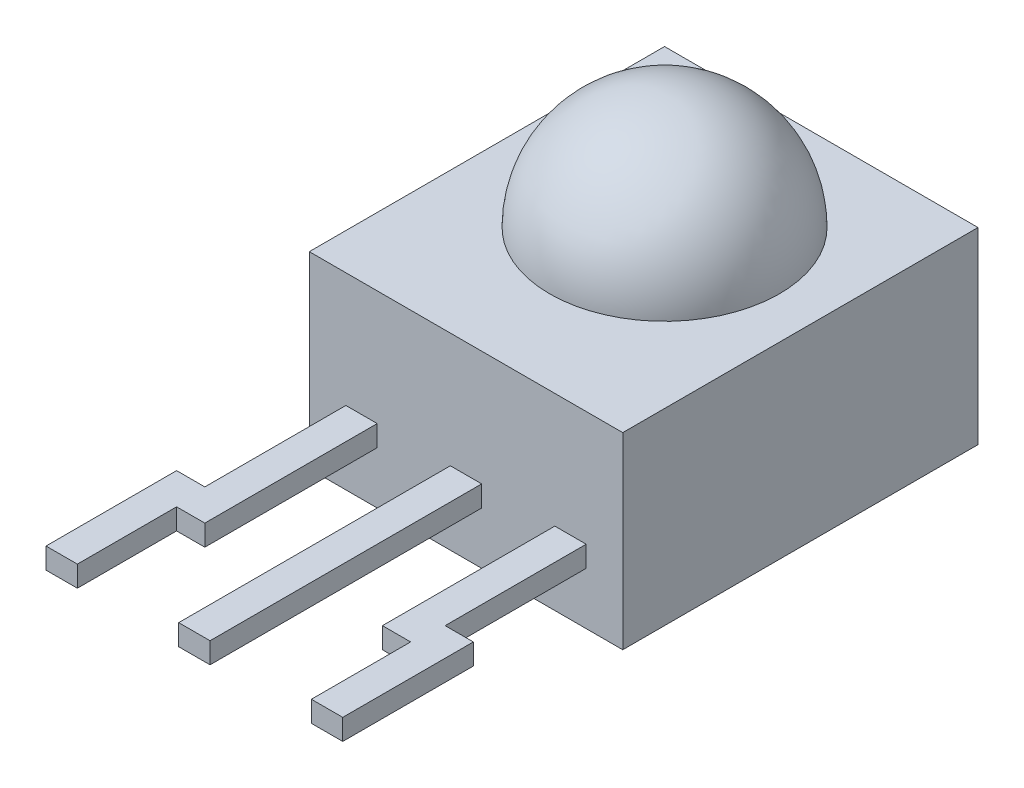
ISO-10303-21;
HEADER;
FILE_DESCRIPTION(('STEP AP214'),'2;1');
FILE_NAME('part.step','',(''),(''),'','','');
FILE_SCHEMA(('AUTOMOTIVE_DESIGN { 1 0 10303 214 1 1 1 1 }'));
ENDSEC;
DATA;
#1=APPLICATION_CONTEXT('core data for automotive mechanical design processes');
#2=APPLICATION_PROTOCOL_DEFINITION('international standard','automotive_design',2000,#1);
#3=PRODUCT_CONTEXT('',#1,'mechanical');
#4=PRODUCT('Part','Part','',(#3));
#5=PRODUCT_RELATED_PRODUCT_CATEGORY('part','',(#4));
#6=PRODUCT_DEFINITION_FORMATION('','',#4);
#7=PRODUCT_DEFINITION_CONTEXT('part definition',#1,'design');
#8=PRODUCT_DEFINITION('design','',#6,#7);
#9=PRODUCT_DEFINITION_SHAPE('','',#8);
#10=(LENGTH_UNIT() NAMED_UNIT(*) SI_UNIT(.MILLI.,.METRE.));
#11=(NAMED_UNIT(*) PLANE_ANGLE_UNIT() SI_UNIT($,.RADIAN.));
#12=(NAMED_UNIT(*) SI_UNIT($,.STERADIAN.) SOLID_ANGLE_UNIT());
#13=UNCERTAINTY_MEASURE_WITH_UNIT(LENGTH_MEASURE(1.E-05),#10,'distance_accuracy_value','');
#14=(GEOMETRIC_REPRESENTATION_CONTEXT(3) GLOBAL_UNCERTAINTY_ASSIGNED_CONTEXT((#13)) GLOBAL_UNIT_ASSIGNED_CONTEXT((#10,
#11,#12)) REPRESENTATION_CONTEXT('',''));
#15=CARTESIAN_POINT('',(0.,0.,0.));
#16=DIRECTION('',(0.,0.,1.));
#17=DIRECTION('',(1.,0.,0.));
#18=AXIS2_PLACEMENT_3D('',#15,#16,#17);
#19=CARTESIAN_POINT('',(-3.,2.4,0.));
#20=DIRECTION('',(0.,0.,-1.));
#21=DIRECTION('',(-1.,0.,0.));
#22=AXIS2_PLACEMENT_3D('',#19,#20,#21);
#23=PLANE('',#22);
#24=DIRECTION('',(-1.,0.,0.));
#25=VECTOR('',#24,1.);
#26=CARTESIAN_POINT('',(-2.3,0.2,0.));
#27=LINE('',#26,#25);
#28=CARTESIAN_POINT('',(-1.7,0.2,0.));
#29=VERTEX_POINT('',#28);
#30=CARTESIAN_POINT('',(-2.3,0.2,0.));
#31=VERTEX_POINT('',#30);
#32=EDGE_CURVE('E305',#29,#31,#27,.T.);
#33=ORIENTED_EDGE('',*,*,#32,.F.);
#34=DIRECTION('',(0.,1.,0.));
#35=VECTOR('',#34,1.);
#36=CARTESIAN_POINT('',(-1.7,0.2,0.));
#37=LINE('',#36,#35);
#38=CARTESIAN_POINT('',(-1.7,-0.2,0.));
#39=VERTEX_POINT('',#38);
#40=EDGE_CURVE('E302',#39,#29,#37,.T.);
#41=ORIENTED_EDGE('',*,*,#40,.F.);
#42=DIRECTION('',(1.,0.,0.));
#43=VECTOR('',#42,1.);
#44=CARTESIAN_POINT('',(-2.3,-0.2,0.));
#45=LINE('',#44,#43);
#46=CARTESIAN_POINT('',(-2.3,-0.2,0.));
#47=VERTEX_POINT('',#46);
#48=EDGE_CURVE('E299',#47,#39,#45,.T.);
#49=ORIENTED_EDGE('',*,*,#48,.F.);
#50=DIRECTION('',(0.,-1.,0.));
#51=VECTOR('',#50,1.);
#52=CARTESIAN_POINT('',(-2.3,0.2,0.));
#53=LINE('',#52,#51);
#54=EDGE_CURVE('E213',#31,#47,#53,.T.);
#55=ORIENTED_EDGE('',*,*,#54,.F.);
#56=EDGE_LOOP('',(#33,#41,#49,#55));
#57=FACE_BOUND('',#56,.T.);
#58=DIRECTION('',(1.,0.,0.));
#59=VECTOR('',#58,1.);
#60=CARTESIAN_POINT('',(-3.,-1.2,0.));
#61=LINE('',#60,#59);
#62=CARTESIAN_POINT('',(-3.,-1.2,0.));
#63=VERTEX_POINT('',#62);
#64=CARTESIAN_POINT('',(3.,-1.2,0.));
#65=VERTEX_POINT('',#64);
#66=EDGE_CURVE('E349',#63,#65,#61,.T.);
#67=ORIENTED_EDGE('',*,*,#66,.T.);
#68=DIRECTION('',(0.,-1.,0.));
#69=VECTOR('',#68,1.);
#70=CARTESIAN_POINT('',(3.,2.4,0.));
#71=LINE('',#70,#69);
#72=CARTESIAN_POINT('',(3.,2.4,0.));
#73=VERTEX_POINT('',#72);
#74=EDGE_CURVE('E25',#73,#65,#71,.T.);
#75=ORIENTED_EDGE('',*,*,#74,.F.);
#76=DIRECTION('',(1.,0.,0.));
#77=VECTOR('',#76,1.);
#78=CARTESIAN_POINT('',(-3.,2.4,0.));
#79=LINE('',#78,#77);
#80=CARTESIAN_POINT('',(-3.,2.4,0.));
#81=VERTEX_POINT('',#80);
#82=EDGE_CURVE('E358',#81,#73,#79,.T.);
#83=ORIENTED_EDGE('',*,*,#82,.F.);
#84=DIRECTION('',(0.,-1.,0.));
#85=VECTOR('',#84,1.);
#86=CARTESIAN_POINT('',(-3.,2.4,0.));
#87=LINE('',#86,#85);
#88=EDGE_CURVE('E11',#81,#63,#87,.T.);
#89=ORIENTED_EDGE('',*,*,#88,.T.);
#90=EDGE_LOOP('',(#67,#75,#83,#89));
#91=FACE_BOUND('',#90,.T.);
#92=DIRECTION('',(1.,0.,0.));
#93=VECTOR('',#92,1.);
#94=CARTESIAN_POINT('',(2.3,0.2,0.));
#95=LINE('',#94,#93);
#96=CARTESIAN_POINT('',(1.7,0.2,0.));
#97=VERTEX_POINT('',#96);
#98=CARTESIAN_POINT('',(2.3,0.2,0.));
#99=VERTEX_POINT('',#98);
#100=EDGE_CURVE('E236',#97,#99,#95,.T.);
#101=ORIENTED_EDGE('',*,*,#100,.T.);
#102=DIRECTION('',(0.,-1.,0.));
#103=VECTOR('',#102,1.);
#104=CARTESIAN_POINT('',(2.3,0.2,0.));
#105=LINE('',#104,#103);
#106=CARTESIAN_POINT('',(2.3,-0.2,0.));
#107=VERTEX_POINT('',#106);
#108=EDGE_CURVE('E209',#99,#107,#105,.T.);
#109=ORIENTED_EDGE('',*,*,#108,.T.);
#110=DIRECTION('',(-1.,0.,0.));
#111=VECTOR('',#110,1.);
#112=CARTESIAN_POINT('',(2.3,-0.2,0.));
#113=LINE('',#112,#111);
#114=CARTESIAN_POINT('',(1.7,-0.2,0.));
#115=VERTEX_POINT('',#114);
#116=EDGE_CURVE('E242',#107,#115,#113,.T.);
#117=ORIENTED_EDGE('',*,*,#116,.T.);
#118=DIRECTION('',(0.,1.,0.));
#119=VECTOR('',#118,1.);
#120=CARTESIAN_POINT('',(1.7,0.2,0.));
#121=LINE('',#120,#119);
#122=EDGE_CURVE('E239',#115,#97,#121,.T.);
#123=ORIENTED_EDGE('',*,*,#122,.T.);
#124=EDGE_LOOP('',(#101,#109,#117,#123));
#125=FACE_BOUND('',#124,.T.);
#126=DIRECTION('',(0.,-1.,0.));
#127=VECTOR('',#126,1.);
#128=CARTESIAN_POINT('',(-0.3,-0.2,0.));
#129=LINE('',#128,#127);
#130=CARTESIAN_POINT('',(-0.3,0.2,0.));
#131=VERTEX_POINT('',#130);
#132=CARTESIAN_POINT('',(-0.3,-0.2,0.));
#133=VERTEX_POINT('',#132);
#134=EDGE_CURVE('E174',#131,#133,#129,.T.);
#135=ORIENTED_EDGE('',*,*,#134,.F.);
#136=DIRECTION('',(-1.,0.,0.));
#137=VECTOR('',#136,1.);
#138=CARTESIAN_POINT('',(-0.3,0.2,0.));
#139=LINE('',#138,#137);
#140=CARTESIAN_POINT('',(0.3,0.2,0.));
#141=VERTEX_POINT('',#140);
#142=EDGE_CURVE('E176',#141,#131,#139,.T.);
#143=ORIENTED_EDGE('',*,*,#142,.F.);
#144=DIRECTION('',(0.,1.,0.));
#145=VECTOR('',#144,1.);
#146=CARTESIAN_POINT('',(0.3,-0.2,0.));
#147=LINE('',#146,#145);
#148=CARTESIAN_POINT('',(0.3,-0.2,0.));
#149=VERTEX_POINT('',#148);
#150=EDGE_CURVE('E37',#149,#141,#147,.T.);
#151=ORIENTED_EDGE('',*,*,#150,.F.);
#152=DIRECTION('',(1.,0.,0.));
#153=VECTOR('',#152,1.);
#154=CARTESIAN_POINT('',(-0.3,-0.2,0.));
#155=LINE('',#154,#153);
#156=EDGE_CURVE('E32',#133,#149,#155,.T.);
#157=ORIENTED_EDGE('',*,*,#156,.F.);
#158=EDGE_LOOP('',(#135,#143,#151,#157));
#159=FACE_BOUND('',#158,.T.);
#160=ADVANCED_FACE('F17',(#57,#91,#125,#159),#23,.F.);
#161=CARTESIAN_POINT('',(-3.,2.4,0.));
#162=DIRECTION('',(0.,1.,0.));
#163=DIRECTION('',(0.,0.,1.));
#164=AXIS2_PLACEMENT_3D('',#161,#162,#163);
#165=PLANE('',#164);
#166=DIRECTION('',(0.,0.,1.));
#167=VECTOR('',#166,1.);
#168=CARTESIAN_POINT('',(-3.,2.4,-6.8));
#169=LINE('',#168,#167);
#170=CARTESIAN_POINT('',(-3.,2.4,-6.8));
#171=VERTEX_POINT('',#170);
#172=EDGE_CURVE('E355',#171,#81,#169,.T.);
#173=ORIENTED_EDGE('',*,*,#172,.T.);
#174=ORIENTED_EDGE('',*,*,#82,.T.);
#175=DIRECTION('',(0.,0.,-1.));
#176=VECTOR('',#175,1.);
#177=CARTESIAN_POINT('',(3.,2.4,-6.8));
#178=LINE('',#177,#176);
#179=CARTESIAN_POINT('',(3.,2.4,-6.8));
#180=VERTEX_POINT('',#179);
#181=EDGE_CURVE('E360',#73,#180,#178,.T.);
#182=ORIENTED_EDGE('',*,*,#181,.T.);
#183=DIRECTION('',(-1.,0.,0.));
#184=VECTOR('',#183,1.);
#185=CARTESIAN_POINT('',(-3.,2.4,-6.8));
#186=LINE('',#185,#184);
#187=EDGE_CURVE('E362',#180,#171,#186,.T.);
#188=ORIENTED_EDGE('',*,*,#187,.T.);
#189=EDGE_LOOP('',(#173,#174,#182,#188));
#190=FACE_BOUND('',#189,.T.);
#191=CARTESIAN_POINT('',(0.,2.4,-3.8));
#192=DIRECTION('',(0.,1.,0.));
#193=DIRECTION('',(0.,0.,1.));
#194=AXIS2_PLACEMENT_3D('',#191,#192,#193);
#195=CIRCLE('',#194,2.2);
#196=CARTESIAN_POINT('',(0.,2.4,-1.6));
#197=VERTEX_POINT('',#196);
#198=EDGE_CURVE('E206',#197,#197,#195,.T.);
#199=ORIENTED_EDGE('',*,*,#198,.F.);
#200=EDGE_LOOP('',(#199));
#201=FACE_BOUND('',#200,.T.);
#202=ADVANCED_FACE('F389',(#190,#201),#165,.T.);
#203=CARTESIAN_POINT('',(-3.,2.4,-6.8));
#204=DIRECTION('',(1.,0.,0.));
#205=DIRECTION('',(0.,0.,-1.));
#206=AXIS2_PLACEMENT_3D('',#203,#204,#205);
#207=PLANE('',#206);
#208=DIRECTION('',(0.,0.,1.));
#209=VECTOR('',#208,1.);
#210=CARTESIAN_POINT('',(-3.,-1.2,-6.8));
#211=LINE('',#210,#209);
#212=CARTESIAN_POINT('',(-3.,-1.2,-6.8));
#213=VERTEX_POINT('',#212);
#214=EDGE_CURVE('E346',#213,#63,#211,.T.);
#215=ORIENTED_EDGE('',*,*,#214,.T.);
#216=ORIENTED_EDGE('',*,*,#88,.F.);
#217=ORIENTED_EDGE('',*,*,#172,.F.);
#218=DIRECTION('',(0.,-1.,0.));
#219=VECTOR('',#218,1.);
#220=CARTESIAN_POINT('',(-3.,2.4,-6.8));
#221=LINE('',#220,#219);
#222=EDGE_CURVE('E364',#171,#213,#221,.T.);
#223=ORIENTED_EDGE('',*,*,#222,.T.);
#224=EDGE_LOOP('',(#215,#216,#217,#223));
#225=FACE_BOUND('',#224,.T.);
#226=ADVANCED_FACE('F19',(#225),#207,.F.);
#227=CARTESIAN_POINT('',(3.,2.4,-6.8));
#228=DIRECTION('',(-1.,0.,0.));
#229=DIRECTION('',(0.,0.,1.));
#230=AXIS2_PLACEMENT_3D('',#227,#228,#229);
#231=PLANE('',#230);
#232=DIRECTION('',(0.,0.,-1.));
#233=VECTOR('',#232,1.);
#234=CARTESIAN_POINT('',(3.,-1.2,-6.8));
#235=LINE('',#234,#233);
#236=CARTESIAN_POINT('',(3.,-1.2,-6.8));
#237=VERTEX_POINT('',#236);
#238=EDGE_CURVE('E351',#65,#237,#235,.T.);
#239=ORIENTED_EDGE('',*,*,#238,.T.);
#240=DIRECTION('',(0.,-1.,0.));
#241=VECTOR('',#240,1.);
#242=CARTESIAN_POINT('',(3.,2.4,-6.8));
#243=LINE('',#242,#241);
#244=EDGE_CURVE('E367',#180,#237,#243,.T.);
#245=ORIENTED_EDGE('',*,*,#244,.F.);
#246=ORIENTED_EDGE('',*,*,#181,.F.);
#247=ORIENTED_EDGE('',*,*,#74,.T.);
#248=EDGE_LOOP('',(#239,#245,#246,#247));
#249=FACE_BOUND('',#248,.T.);
#250=ADVANCED_FACE('F374',(#249),#231,.F.);
#251=CARTESIAN_POINT('',(-3.,2.4,-6.8));
#252=DIRECTION('',(0.,0.,1.));
#253=DIRECTION('',(1.,0.,0.));
#254=AXIS2_PLACEMENT_3D('',#251,#252,#253);
#255=PLANE('',#254);
#256=DIRECTION('',(-1.,0.,0.));
#257=VECTOR('',#256,1.);
#258=CARTESIAN_POINT('',(-3.,-1.2,-6.8));
#259=LINE('',#258,#257);
#260=EDGE_CURVE('E353',#237,#213,#259,.T.);
#261=ORIENTED_EDGE('',*,*,#260,.T.);
#262=ORIENTED_EDGE('',*,*,#222,.F.);
#263=ORIENTED_EDGE('',*,*,#187,.F.);
#264=ORIENTED_EDGE('',*,*,#244,.T.);
#265=EDGE_LOOP('',(#261,#262,#263,#264));
#266=FACE_BOUND('',#265,.T.);
#267=ADVANCED_FACE('F383',(#266),#255,.F.);
#268=CARTESIAN_POINT('',(-3.,-1.2,0.));
#269=DIRECTION('',(0.,1.,0.));
#270=DIRECTION('',(0.,0.,1.));
#271=AXIS2_PLACEMENT_3D('',#268,#269,#270);
#272=PLANE('',#271);
#273=ORIENTED_EDGE('',*,*,#214,.F.);
#274=ORIENTED_EDGE('',*,*,#260,.F.);
#275=ORIENTED_EDGE('',*,*,#238,.F.);
#276=ORIENTED_EDGE('',*,*,#66,.F.);
#277=EDGE_LOOP('',(#273,#274,#275,#276));
#278=FACE_BOUND('',#277,.T.);
#279=ADVANCED_FACE('F380',(#278),#272,.F.);
#280=CARTESIAN_POINT('',(-2.84,0.2,2.7));
#281=DIRECTION('',(1.,0.,0.));
#282=DIRECTION('',(0.,0.,-1.));
#283=AXIS2_PLACEMENT_3D('',#280,#281,#282);
#284=PLANE('',#283);
#285=DIRECTION('',(0.,-1.,0.));
#286=VECTOR('',#285,1.);
#287=CARTESIAN_POINT('',(-2.84,0.2,5.2));
#288=LINE('',#287,#286);
#289=CARTESIAN_POINT('',(-2.84,0.2,5.2));
#290=VERTEX_POINT('',#289);
#291=CARTESIAN_POINT('',(-2.84,-0.2,5.2));
#292=VERTEX_POINT('',#291);
#293=EDGE_CURVE('E284',#290,#292,#288,.T.);
#294=ORIENTED_EDGE('',*,*,#293,.F.);
#295=DIRECTION('',(0.,0.,1.));
#296=VECTOR('',#295,1.);
#297=CARTESIAN_POINT('',(-2.84,0.2,2.7));
#298=LINE('',#297,#296);
#299=CARTESIAN_POINT('',(-2.84,0.2,2.7));
#300=VERTEX_POINT('',#299);
#301=EDGE_CURVE('E290',#300,#290,#298,.T.);
#302=ORIENTED_EDGE('',*,*,#301,.F.);
#303=DIRECTION('',(0.,1.,0.));
#304=VECTOR('',#303,1.);
#305=CARTESIAN_POINT('',(-2.84,0.2,2.7));
#306=LINE('',#305,#304);
#307=CARTESIAN_POINT('',(-2.84,-0.2,2.7));
#308=VERTEX_POINT('',#307);
#309=EDGE_CURVE('E291',#308,#300,#306,.T.);
#310=ORIENTED_EDGE('',*,*,#309,.F.);
#311=DIRECTION('',(0.,0.,1.));
#312=VECTOR('',#311,1.);
#313=CARTESIAN_POINT('',(-2.84,-0.2,2.7));
#314=LINE('',#313,#312);
#315=EDGE_CURVE('E282',#308,#292,#314,.T.);
#316=ORIENTED_EDGE('',*,*,#315,.T.);
#317=EDGE_LOOP('',(#294,#302,#310,#316));
#318=FACE_BOUND('',#317,.T.);
#319=ADVANCED_FACE('F467',(#318),#284,.F.);
#320=CARTESIAN_POINT('',(-2.24,0.2,3.3));
#321=DIRECTION('',(-1.,0.,0.));
#322=DIRECTION('',(0.,0.,1.));
#323=AXIS2_PLACEMENT_3D('',#320,#321,#322);
#324=PLANE('',#323);
#325=DIRECTION('',(0.,1.,0.));
#326=VECTOR('',#325,1.);
#327=CARTESIAN_POINT('',(-2.24,0.2,5.2));
#328=LINE('',#327,#326);
#329=CARTESIAN_POINT('',(-2.24,-0.2,5.2));
#330=VERTEX_POINT('',#329);
#331=CARTESIAN_POINT('',(-2.24,0.2,5.2));
#332=VERTEX_POINT('',#331);
#333=EDGE_CURVE('E279',#330,#332,#328,.T.);
#334=ORIENTED_EDGE('',*,*,#333,.F.);
#335=DIRECTION('',(0.,0.,1.));
#336=VECTOR('',#335,1.);
#337=CARTESIAN_POINT('',(-2.24,-0.2,3.3));
#338=LINE('',#337,#336);
#339=CARTESIAN_POINT('',(-2.24,-0.2,3.3));
#340=VERTEX_POINT('',#339);
#341=EDGE_CURVE('E340',#340,#330,#338,.T.);
#342=ORIENTED_EDGE('',*,*,#341,.F.);
#343=DIRECTION('',(0.,-1.,0.));
#344=VECTOR('',#343,1.);
#345=CARTESIAN_POINT('',(-2.24,0.2,3.3));
#346=LINE('',#345,#344);
#347=CARTESIAN_POINT('',(-2.24,0.2,3.3));
#348=VERTEX_POINT('',#347);
#349=EDGE_CURVE('E287',#348,#340,#346,.T.);
#350=ORIENTED_EDGE('',*,*,#349,.F.);
#351=DIRECTION('',(0.,0.,1.));
#352=VECTOR('',#351,1.);
#353=CARTESIAN_POINT('',(-2.24,0.2,3.3));
#354=LINE('',#353,#352);
#355=EDGE_CURVE('E337',#348,#332,#354,.T.);
#356=ORIENTED_EDGE('',*,*,#355,.T.);
#357=EDGE_LOOP('',(#334,#342,#350,#356));
#358=FACE_BOUND('',#357,.T.);
#359=ADVANCED_FACE('F462',(#358),#324,.F.);
#360=CARTESIAN_POINT('',(-1.7,0.2,3.3));
#361=DIRECTION('',(0.,0.,1.));
#362=DIRECTION('',(1.,0.,0.));
#363=AXIS2_PLACEMENT_3D('',#360,#361,#362);
#364=PLANE('',#363);
#365=DIRECTION('',(-1.,0.,0.));
#366=VECTOR('',#365,1.);
#367=CARTESIAN_POINT('',(-1.7,0.2,3.3));
#368=LINE('',#367,#366);
#369=CARTESIAN_POINT('',(-1.7,0.2,3.3));
#370=VERTEX_POINT('',#369);
#371=EDGE_CURVE('E321',#370,#348,#368,.T.);
#372=ORIENTED_EDGE('',*,*,#371,.T.);
#373=ORIENTED_EDGE('',*,*,#349,.T.);
#374=DIRECTION('',(-1.,0.,0.));
#375=VECTOR('',#374,1.);
#376=CARTESIAN_POINT('',(-1.7,-0.2,3.3));
#377=LINE('',#376,#375);
#378=CARTESIAN_POINT('',(-1.7,-0.2,3.3));
#379=VERTEX_POINT('',#378);
#380=EDGE_CURVE('E324',#379,#340,#377,.T.);
#381=ORIENTED_EDGE('',*,*,#380,.F.);
#382=DIRECTION('',(0.,1.,0.));
#383=VECTOR('',#382,1.);
#384=CARTESIAN_POINT('',(-1.7,0.2,3.3));
#385=LINE('',#384,#383);
#386=EDGE_CURVE('E292',#379,#370,#385,.T.);
#387=ORIENTED_EDGE('',*,*,#386,.T.);
#388=EDGE_LOOP('',(#372,#373,#381,#387));
#389=FACE_BOUND('',#388,.T.);
#390=ADVANCED_FACE('F459',(#389),#364,.T.);
#391=CARTESIAN_POINT('',(-2.3,0.2,2.7));
#392=DIRECTION('',(0.,0.,-1.));
#393=DIRECTION('',(-1.,0.,0.));
#394=AXIS2_PLACEMENT_3D('',#391,#392,#393);
#395=PLANE('',#394);
#396=DIRECTION('',(-1.,0.,0.));
#397=VECTOR('',#396,1.);
#398=CARTESIAN_POINT('',(-2.3,-0.2,2.7));
#399=LINE('',#398,#397);
#400=CARTESIAN_POINT('',(-2.3,-0.2,2.7));
#401=VERTEX_POINT('',#400);
#402=EDGE_CURVE('E327',#401,#308,#399,.T.);
#403=ORIENTED_EDGE('',*,*,#402,.T.);
#404=ORIENTED_EDGE('',*,*,#309,.T.);
#405=DIRECTION('',(-1.,0.,0.));
#406=VECTOR('',#405,1.);
#407=CARTESIAN_POINT('',(-2.3,0.2,2.7));
#408=LINE('',#407,#406);
#409=CARTESIAN_POINT('',(-2.3,0.2,2.7));
#410=VERTEX_POINT('',#409);
#411=EDGE_CURVE('E330',#410,#300,#408,.T.);
#412=ORIENTED_EDGE('',*,*,#411,.F.);
#413=DIRECTION('',(0.,-1.,0.));
#414=VECTOR('',#413,1.);
#415=CARTESIAN_POINT('',(-2.3,0.2,2.7));
#416=LINE('',#415,#414);
#417=EDGE_CURVE('E295',#410,#401,#416,.T.);
#418=ORIENTED_EDGE('',*,*,#417,.T.);
#419=EDGE_LOOP('',(#403,#404,#412,#418));
#420=FACE_BOUND('',#419,.T.);
#421=ADVANCED_FACE('F447',(#420),#395,.T.);
#422=CARTESIAN_POINT('',(-2.3,0.2,3.7211102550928));
#423=DIRECTION('',(0.,-1.,0.));
#424=DIRECTION('',(0.,0.,-1.));
#425=AXIS2_PLACEMENT_3D('',#422,#423,#424);
#426=PLANE('',#425);
#427=DIRECTION('',(0.,0.,-1.));
#428=VECTOR('',#427,1.);
#429=CARTESIAN_POINT('',(-2.3,0.2,3.7211102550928));
#430=LINE('',#429,#428);
#431=EDGE_CURVE('E308',#410,#31,#430,.T.);
#432=ORIENTED_EDGE('',*,*,#431,.F.);
#433=ORIENTED_EDGE('',*,*,#411,.T.);
#434=ORIENTED_EDGE('',*,*,#301,.T.);
#435=DIRECTION('',(-1.,0.,0.));
#436=VECTOR('',#435,1.);
#437=CARTESIAN_POINT('',(-2.0594448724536,0.2,5.2));
#438=LINE('',#437,#436);
#439=EDGE_CURVE('E281',#332,#290,#438,.T.);
#440=ORIENTED_EDGE('',*,*,#439,.F.);
#441=ORIENTED_EDGE('',*,*,#355,.F.);
#442=ORIENTED_EDGE('',*,*,#371,.F.);
#443=DIRECTION('',(0.,0.,-1.));
#444=VECTOR('',#443,1.);
#445=CARTESIAN_POINT('',(-1.7,0.2,3.7211102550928));
#446=LINE('',#445,#444);
#447=EDGE_CURVE('E311',#370,#29,#446,.T.);
#448=ORIENTED_EDGE('',*,*,#447,.T.);
#449=ORIENTED_EDGE('',*,*,#32,.T.);
#450=EDGE_LOOP('',(#432,#433,#434,#440,#441,#442,#448,#449));
#451=FACE_BOUND('',#450,.T.);
#452=ADVANCED_FACE('F443',(#451),#426,.F.);
#453=CARTESIAN_POINT('',(-1.7,0.2,3.7211102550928));
#454=DIRECTION('',(-1.,0.,0.));
#455=DIRECTION('',(0.,0.,1.));
#456=AXIS2_PLACEMENT_3D('',#453,#454,#455);
#457=PLANE('',#456);
#458=ORIENTED_EDGE('',*,*,#386,.F.);
#459=DIRECTION('',(0.,0.,-1.));
#460=VECTOR('',#459,1.);
#461=CARTESIAN_POINT('',(-1.7,-0.2,3.7211102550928));
#462=LINE('',#461,#460);
#463=EDGE_CURVE('E314',#379,#39,#462,.T.);
#464=ORIENTED_EDGE('',*,*,#463,.T.);
#465=ORIENTED_EDGE('',*,*,#40,.T.);
#466=ORIENTED_EDGE('',*,*,#447,.F.);
#467=EDGE_LOOP('',(#458,#464,#465,#466));
#468=FACE_BOUND('',#467,.T.);
#469=ADVANCED_FACE('F446',(#468),#457,.F.);
#470=CARTESIAN_POINT('',(-2.3,-0.2,3.7211102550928));
#471=DIRECTION('',(0.,1.,0.));
#472=DIRECTION('',(0.,0.,1.));
#473=AXIS2_PLACEMENT_3D('',#470,#471,#472);
#474=PLANE('',#473);
#475=ORIENTED_EDGE('',*,*,#463,.F.);
#476=ORIENTED_EDGE('',*,*,#380,.T.);
#477=ORIENTED_EDGE('',*,*,#341,.T.);
#478=DIRECTION('',(1.,0.,0.));
#479=VECTOR('',#478,1.);
#480=CARTESIAN_POINT('',(-2.0594448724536,-0.2,5.2));
#481=LINE('',#480,#479);
#482=EDGE_CURVE('E286',#292,#330,#481,.T.);
#483=ORIENTED_EDGE('',*,*,#482,.F.);
#484=ORIENTED_EDGE('',*,*,#315,.F.);
#485=ORIENTED_EDGE('',*,*,#402,.F.);
#486=DIRECTION('',(0.,0.,-1.));
#487=VECTOR('',#486,1.);
#488=CARTESIAN_POINT('',(-2.3,-0.2,3.7211102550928));
#489=LINE('',#488,#487);
#490=EDGE_CURVE('E296',#401,#47,#489,.T.);
#491=ORIENTED_EDGE('',*,*,#490,.T.);
#492=ORIENTED_EDGE('',*,*,#48,.T.);
#493=EDGE_LOOP('',(#475,#476,#477,#483,#484,#485,#491,#492));
#494=FACE_BOUND('',#493,.T.);
#495=ADVANCED_FACE('F451',(#494),#474,.F.);
#496=CARTESIAN_POINT('',(-2.3,0.2,3.7211102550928));
#497=DIRECTION('',(1.,0.,0.));
#498=DIRECTION('',(0.,0.,-1.));
#499=AXIS2_PLACEMENT_3D('',#496,#497,#498);
#500=PLANE('',#499);
#501=ORIENTED_EDGE('',*,*,#417,.F.);
#502=ORIENTED_EDGE('',*,*,#431,.T.);
#503=ORIENTED_EDGE('',*,*,#54,.T.);
#504=ORIENTED_EDGE('',*,*,#490,.F.);
#505=EDGE_LOOP('',(#501,#502,#503,#504));
#506=FACE_BOUND('',#505,.T.);
#507=ADVANCED_FACE('F441',(#506),#500,.F.);
#508=CARTESIAN_POINT('',(-2.54,0.,5.2));
#509=DIRECTION('',(0.,0.,1.));
#510=DIRECTION('',(1.,0.,0.));
#511=AXIS2_PLACEMENT_3D('',#508,#509,#510);
#512=PLANE('',#511);
#513=ORIENTED_EDGE('',*,*,#293,.T.);
#514=ORIENTED_EDGE('',*,*,#482,.T.);
#515=ORIENTED_EDGE('',*,*,#333,.T.);
#516=ORIENTED_EDGE('',*,*,#439,.T.);
#517=EDGE_LOOP('',(#513,#514,#515,#516));
#518=FACE_BOUND('',#517,.T.);
#519=ADVANCED_FACE('F436',(#518),#512,.T.);
#520=CARTESIAN_POINT('',(2.24,0.2,3.3));
#521=DIRECTION('',(-1.,0.,0.));
#522=DIRECTION('',(0.,0.,1.));
#523=AXIS2_PLACEMENT_3D('',#520,#521,#522);
#524=PLANE('',#523);
#525=DIRECTION('',(0.,0.,1.));
#526=VECTOR('',#525,1.);
#527=CARTESIAN_POINT('',(2.24,-0.2,3.3));
#528=LINE('',#527,#526);
#529=CARTESIAN_POINT('',(2.24,-0.2,3.3));
#530=VERTEX_POINT('',#529);
#531=CARTESIAN_POINT('',(2.24,-0.2,5.2));
#532=VERTEX_POINT('',#531);
#533=EDGE_CURVE('E274',#530,#532,#528,.T.);
#534=ORIENTED_EDGE('',*,*,#533,.T.);
#535=DIRECTION('',(0.,1.,0.));
#536=VECTOR('',#535,1.);
#537=CARTESIAN_POINT('',(2.24,0.2,5.2));
#538=LINE('',#537,#536);
#539=CARTESIAN_POINT('',(2.24,0.2,5.2));
#540=VERTEX_POINT('',#539);
#541=EDGE_CURVE('E217',#532,#540,#538,.T.);
#542=ORIENTED_EDGE('',*,*,#541,.T.);
#543=DIRECTION('',(0.,0.,1.));
#544=VECTOR('',#543,1.);
#545=CARTESIAN_POINT('',(2.24,0.2,3.3));
#546=LINE('',#545,#544);
#547=CARTESIAN_POINT('',(2.24,0.2,3.3));
#548=VERTEX_POINT('',#547);
#549=EDGE_CURVE('E228',#548,#540,#546,.T.);
#550=ORIENTED_EDGE('',*,*,#549,.F.);
#551=DIRECTION('',(0.,-1.,0.));
#552=VECTOR('',#551,1.);
#553=CARTESIAN_POINT('',(2.24,0.2,3.3));
#554=LINE('',#553,#552);
#555=EDGE_CURVE('E224',#548,#530,#554,.T.);
#556=ORIENTED_EDGE('',*,*,#555,.T.);
#557=EDGE_LOOP('',(#534,#542,#550,#556));
#558=FACE_BOUND('',#557,.T.);
#559=ADVANCED_FACE('F415',(#558),#524,.T.);
#560=CARTESIAN_POINT('',(2.84,0.2,2.7));
#561=DIRECTION('',(1.,0.,0.));
#562=DIRECTION('',(0.,0.,-1.));
#563=AXIS2_PLACEMENT_3D('',#560,#561,#562);
#564=PLANE('',#563);
#565=DIRECTION('',(0.,0.,1.));
#566=VECTOR('',#565,1.);
#567=CARTESIAN_POINT('',(2.84,0.2,2.7));
#568=LINE('',#567,#566);
#569=CARTESIAN_POINT('',(2.84,0.2,2.7));
#570=VERTEX_POINT('',#569);
#571=CARTESIAN_POINT('',(2.84,0.2,5.2));
#572=VERTEX_POINT('',#571);
#573=EDGE_CURVE('E268',#570,#572,#568,.T.);
#574=ORIENTED_EDGE('',*,*,#573,.T.);
#575=DIRECTION('',(0.,-1.,0.));
#576=VECTOR('',#575,1.);
#577=CARTESIAN_POINT('',(2.84,0.2,5.2));
#578=LINE('',#577,#576);
#579=CARTESIAN_POINT('',(2.84,-0.2,5.2));
#580=VERTEX_POINT('',#579);
#581=EDGE_CURVE('E210',#572,#580,#578,.T.);
#582=ORIENTED_EDGE('',*,*,#581,.T.);
#583=DIRECTION('',(0.,0.,1.));
#584=VECTOR('',#583,1.);
#585=CARTESIAN_POINT('',(2.84,-0.2,2.7));
#586=LINE('',#585,#584);
#587=CARTESIAN_POINT('',(2.84,-0.2,2.7));
#588=VERTEX_POINT('',#587);
#589=EDGE_CURVE('E271',#588,#580,#586,.T.);
#590=ORIENTED_EDGE('',*,*,#589,.F.);
#591=DIRECTION('',(0.,1.,0.));
#592=VECTOR('',#591,1.);
#593=CARTESIAN_POINT('',(2.84,0.2,2.7));
#594=LINE('',#593,#592);
#595=EDGE_CURVE('E221',#588,#570,#594,.T.);
#596=ORIENTED_EDGE('',*,*,#595,.T.);
#597=EDGE_LOOP('',(#574,#582,#590,#596));
#598=FACE_BOUND('',#597,.T.);
#599=ADVANCED_FACE('F419',(#598),#564,.T.);
#600=CARTESIAN_POINT('',(1.7,0.2,3.3));
#601=DIRECTION('',(0.,0.,-1.));
#602=DIRECTION('',(-1.,0.,0.));
#603=AXIS2_PLACEMENT_3D('',#600,#601,#602);
#604=PLANE('',#603);
#605=ORIENTED_EDGE('',*,*,#555,.F.);
#606=DIRECTION('',(1.,0.,0.));
#607=VECTOR('',#606,1.);
#608=CARTESIAN_POINT('',(1.7,0.2,3.3));
#609=LINE('',#608,#607);
#610=CARTESIAN_POINT('',(1.7,0.2,3.3));
#611=VERTEX_POINT('',#610);
#612=EDGE_CURVE('E232',#611,#548,#609,.T.);
#613=ORIENTED_EDGE('',*,*,#612,.F.);
#614=DIRECTION('',(0.,1.,0.));
#615=VECTOR('',#614,1.);
#616=CARTESIAN_POINT('',(1.7,0.2,3.3));
#617=LINE('',#616,#615);
#618=CARTESIAN_POINT('',(1.7,-0.2,3.3));
#619=VERTEX_POINT('',#618);
#620=EDGE_CURVE('E229',#619,#611,#617,.T.);
#621=ORIENTED_EDGE('',*,*,#620,.F.);
#622=DIRECTION('',(1.,0.,0.));
#623=VECTOR('',#622,1.);
#624=CARTESIAN_POINT('',(1.7,-0.2,3.3));
#625=LINE('',#624,#623);
#626=EDGE_CURVE('E225',#619,#530,#625,.T.);
#627=ORIENTED_EDGE('',*,*,#626,.T.);
#628=EDGE_LOOP('',(#605,#613,#621,#627));
#629=FACE_BOUND('',#628,.T.);
#630=ADVANCED_FACE('F413',(#629),#604,.F.);
#631=CARTESIAN_POINT('',(2.3,0.2,2.7));
#632=DIRECTION('',(0.,0.,1.));
#633=DIRECTION('',(1.,0.,0.));
#634=AXIS2_PLACEMENT_3D('',#631,#632,#633);
#635=PLANE('',#634);
#636=ORIENTED_EDGE('',*,*,#595,.F.);
#637=DIRECTION('',(1.,0.,0.));
#638=VECTOR('',#637,1.);
#639=CARTESIAN_POINT('',(2.3,-0.2,2.7));
#640=LINE('',#639,#638);
#641=CARTESIAN_POINT('',(2.3,-0.2,2.7));
#642=VERTEX_POINT('',#641);
#643=EDGE_CURVE('E261',#642,#588,#640,.T.);
#644=ORIENTED_EDGE('',*,*,#643,.F.);
#645=DIRECTION('',(0.,-1.,0.));
#646=VECTOR('',#645,1.);
#647=CARTESIAN_POINT('',(2.3,0.2,2.7));
#648=LINE('',#647,#646);
#649=CARTESIAN_POINT('',(2.3,0.2,2.7));
#650=VERTEX_POINT('',#649);
#651=EDGE_CURVE('E233',#650,#642,#648,.T.);
#652=ORIENTED_EDGE('',*,*,#651,.F.);
#653=DIRECTION('',(1.,0.,0.));
#654=VECTOR('',#653,1.);
#655=CARTESIAN_POINT('',(2.3,0.2,2.7));
#656=LINE('',#655,#654);
#657=EDGE_CURVE('E258',#650,#570,#656,.T.);
#658=ORIENTED_EDGE('',*,*,#657,.T.);
#659=EDGE_LOOP('',(#636,#644,#652,#658));
#660=FACE_BOUND('',#659,.T.);
#661=ADVANCED_FACE('F422',(#660),#635,.F.);
#662=CARTESIAN_POINT('',(2.3,0.2,3.7211102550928));
#663=DIRECTION('',(1.,0.,0.));
#664=DIRECTION('',(0.,0.,-1.));
#665=AXIS2_PLACEMENT_3D('',#662,#663,#664);
#666=PLANE('',#665);
#667=DIRECTION('',(0.,0.,-1.));
#668=VECTOR('',#667,1.);
#669=CARTESIAN_POINT('',(2.3,0.2,3.7211102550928));
#670=LINE('',#669,#668);
#671=EDGE_CURVE('E251',#650,#99,#670,.T.);
#672=ORIENTED_EDGE('',*,*,#671,.F.);
#673=ORIENTED_EDGE('',*,*,#651,.T.);
#674=DIRECTION('',(0.,0.,-1.));
#675=VECTOR('',#674,1.);
#676=CARTESIAN_POINT('',(2.3,-0.2,3.7211102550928));
#677=LINE('',#676,#675);
#678=EDGE_CURVE('E245',#642,#107,#677,.T.);
#679=ORIENTED_EDGE('',*,*,#678,.T.);
#680=ORIENTED_EDGE('',*,*,#108,.F.);
#681=EDGE_LOOP('',(#672,#673,#679,#680));
#682=FACE_BOUND('',#681,.T.);
#683=ADVANCED_FACE('F402',(#682),#666,.T.);
#684=CARTESIAN_POINT('',(2.3,-0.2,3.7211102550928));
#685=DIRECTION('',(0.,-1.,0.));
#686=DIRECTION('',(0.,0.,-1.));
#687=AXIS2_PLACEMENT_3D('',#684,#685,#686);
#688=PLANE('',#687);
#689=ORIENTED_EDGE('',*,*,#678,.F.);
#690=ORIENTED_EDGE('',*,*,#643,.T.);
#691=ORIENTED_EDGE('',*,*,#589,.T.);
#692=DIRECTION('',(-1.,0.,0.));
#693=VECTOR('',#692,1.);
#694=CARTESIAN_POINT('',(2.0594448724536,-0.2,5.2));
#695=LINE('',#694,#693);
#696=EDGE_CURVE('E220',#580,#532,#695,.T.);
#697=ORIENTED_EDGE('',*,*,#696,.T.);
#698=ORIENTED_EDGE('',*,*,#533,.F.);
#699=ORIENTED_EDGE('',*,*,#626,.F.);
#700=DIRECTION('',(0.,0.,-1.));
#701=VECTOR('',#700,1.);
#702=CARTESIAN_POINT('',(1.7,-0.2,3.7211102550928));
#703=LINE('',#702,#701);
#704=EDGE_CURVE('E247',#619,#115,#703,.T.);
#705=ORIENTED_EDGE('',*,*,#704,.T.);
#706=ORIENTED_EDGE('',*,*,#116,.F.);
#707=EDGE_LOOP('',(#689,#690,#691,#697,#698,#699,#705,#706));
#708=FACE_BOUND('',#707,.T.);
#709=ADVANCED_FACE('F406',(#708),#688,.T.);
#710=CARTESIAN_POINT('',(1.7,0.2,3.7211102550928));
#711=DIRECTION('',(-1.,0.,0.));
#712=DIRECTION('',(0.,0.,1.));
#713=AXIS2_PLACEMENT_3D('',#710,#711,#712);
#714=PLANE('',#713);
#715=ORIENTED_EDGE('',*,*,#704,.F.);
#716=ORIENTED_EDGE('',*,*,#620,.T.);
#717=DIRECTION('',(0.,0.,-1.));
#718=VECTOR('',#717,1.);
#719=CARTESIAN_POINT('',(1.7,0.2,3.7211102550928));
#720=LINE('',#719,#718);
#721=EDGE_CURVE('E249',#611,#97,#720,.T.);
#722=ORIENTED_EDGE('',*,*,#721,.T.);
#723=ORIENTED_EDGE('',*,*,#122,.F.);
#724=EDGE_LOOP('',(#715,#716,#722,#723));
#725=FACE_BOUND('',#724,.T.);
#726=ADVANCED_FACE('F410',(#725),#714,.T.);
#727=CARTESIAN_POINT('',(2.3,0.2,3.7211102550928));
#728=DIRECTION('',(0.,1.,0.));
#729=DIRECTION('',(0.,0.,1.));
#730=AXIS2_PLACEMENT_3D('',#727,#728,#729);
#731=PLANE('',#730);
#732=ORIENTED_EDGE('',*,*,#721,.F.);
#733=ORIENTED_EDGE('',*,*,#612,.T.);
#734=ORIENTED_EDGE('',*,*,#549,.T.);
#735=DIRECTION('',(1.,0.,0.));
#736=VECTOR('',#735,1.);
#737=CARTESIAN_POINT('',(2.0594448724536,0.2,5.2));
#738=LINE('',#737,#736);
#739=EDGE_CURVE('E214',#540,#572,#738,.T.);
#740=ORIENTED_EDGE('',*,*,#739,.T.);
#741=ORIENTED_EDGE('',*,*,#573,.F.);
#742=ORIENTED_EDGE('',*,*,#657,.F.);
#743=ORIENTED_EDGE('',*,*,#671,.T.);
#744=ORIENTED_EDGE('',*,*,#100,.F.);
#745=EDGE_LOOP('',(#732,#733,#734,#740,#741,#742,#743,#744));
#746=FACE_BOUND('',#745,.T.);
#747=ADVANCED_FACE('F398',(#746),#731,.T.);
#748=CARTESIAN_POINT('',(2.54,0.,5.2));
#749=DIRECTION('',(0.,0.,1.));
#750=DIRECTION('',(1.,0.,0.));
#751=AXIS2_PLACEMENT_3D('',#748,#749,#750);
#752=PLANE('',#751);
#753=ORIENTED_EDGE('',*,*,#696,.F.);
#754=ORIENTED_EDGE('',*,*,#581,.F.);
#755=ORIENTED_EDGE('',*,*,#739,.F.);
#756=ORIENTED_EDGE('',*,*,#541,.F.);
#757=EDGE_LOOP('',(#753,#754,#755,#756));
#758=FACE_BOUND('',#757,.T.);
#759=ADVANCED_FACE('F417',(#758),#752,.T.);
#760=CARTESIAN_POINT('',(0.,2.4,-3.8));
#761=DIRECTION('',(0.,0.,1.));
#762=DIRECTION('',(1.,0.,0.));
#763=AXIS2_PLACEMENT_3D('',#760,#761,#762);
#764=SPHERICAL_SURFACE('',#763,2.2);
#765=CARTESIAN_POINT('',(0.,2.4,-3.8));
#766=DIRECTION('',(0.,1.,0.));
#767=DIRECTION('',(0.,0.,1.));
#768=AXIS2_PLACEMENT_3D('',#765,#766,#767);
#769=SPHERICAL_SURFACE('',#768,2.2);
#770=ORIENTED_EDGE('',*,*,#198,.T.);
#771=EDGE_LOOP('',(#770));
#772=FACE_BOUND('',#771,.T.);
#773=ADVANCED_FACE('F670',(#772),#769,.T.);
#774=CARTESIAN_POINT('',(-0.3,-0.2,5.2));
#775=DIRECTION('',(1.,0.,0.));
#776=DIRECTION('',(0.,0.,-1.));
#777=AXIS2_PLACEMENT_3D('',#774,#775,#776);
#778=PLANE('',#777);
#779=ORIENTED_EDGE('',*,*,#134,.T.);
#780=DIRECTION('',(0.,0.,-1.));
#781=VECTOR('',#780,1.);
#782=CARTESIAN_POINT('',(-0.3,-0.2,5.2));
#783=LINE('',#782,#781);
#784=CARTESIAN_POINT('',(-0.3,-0.2,5.2));
#785=VERTEX_POINT('',#784);
#786=EDGE_CURVE('E204',#785,#133,#783,.T.);
#787=ORIENTED_EDGE('',*,*,#786,.F.);
#788=DIRECTION('',(0.,-1.,0.));
#789=VECTOR('',#788,1.);
#790=CARTESIAN_POINT('',(-0.3,-0.2,5.2));
#791=LINE('',#790,#789);
#792=CARTESIAN_POINT('',(-0.3,0.2,5.2));
#793=VERTEX_POINT('',#792);
#794=EDGE_CURVE('E190',#793,#785,#791,.T.);
#795=ORIENTED_EDGE('',*,*,#794,.F.);
#796=DIRECTION('',(0.,0.,-1.));
#797=VECTOR('',#796,1.);
#798=CARTESIAN_POINT('',(-0.3,0.2,5.2));
#799=LINE('',#798,#797);
#800=EDGE_CURVE('E186',#793,#131,#799,.T.);
#801=ORIENTED_EDGE('',*,*,#800,.T.);
#802=EDGE_LOOP('',(#779,#787,#795,#801));
#803=FACE_BOUND('',#802,.T.);
#804=ADVANCED_FACE('F192',(#803),#778,.F.);
#805=CARTESIAN_POINT('',(-0.3,-0.2,5.2));
#806=DIRECTION('',(0.,1.,0.));
#807=DIRECTION('',(0.,0.,1.));
#808=AXIS2_PLACEMENT_3D('',#805,#806,#807);
#809=PLANE('',#808);
#810=ORIENTED_EDGE('',*,*,#156,.T.);
#811=DIRECTION('',(0.,0.,-1.));
#812=VECTOR('',#811,1.);
#813=CARTESIAN_POINT('',(0.3,-0.2,5.2));
#814=LINE('',#813,#812);
#815=CARTESIAN_POINT('',(0.3,-0.2,5.2));
#816=VERTEX_POINT('',#815);
#817=EDGE_CURVE('E196',#816,#149,#814,.T.);
#818=ORIENTED_EDGE('',*,*,#817,.F.);
#819=DIRECTION('',(1.,0.,0.));
#820=VECTOR('',#819,1.);
#821=CARTESIAN_POINT('',(-0.3,-0.2,5.2));
#822=LINE('',#821,#820);
#823=EDGE_CURVE('E732',#785,#816,#822,.T.);
#824=ORIENTED_EDGE('',*,*,#823,.F.);
#825=ORIENTED_EDGE('',*,*,#786,.T.);
#826=EDGE_LOOP('',(#810,#818,#824,#825));
#827=FACE_BOUND('',#826,.T.);
#828=ADVANCED_FACE('F689',(#827),#809,.F.);
#829=CARTESIAN_POINT('',(0.3,-0.2,5.2));
#830=DIRECTION('',(-1.,0.,0.));
#831=DIRECTION('',(0.,0.,1.));
#832=AXIS2_PLACEMENT_3D('',#829,#830,#831);
#833=PLANE('',#832);
#834=ORIENTED_EDGE('',*,*,#150,.T.);
#835=DIRECTION('',(0.,0.,-1.));
#836=VECTOR('',#835,1.);
#837=CARTESIAN_POINT('',(0.3,0.2,5.2));
#838=LINE('',#837,#836);
#839=CARTESIAN_POINT('',(0.3,0.2,5.2));
#840=VERTEX_POINT('',#839);
#841=EDGE_CURVE('E189',#840,#141,#838,.T.);
#842=ORIENTED_EDGE('',*,*,#841,.F.);
#843=DIRECTION('',(0.,1.,0.));
#844=VECTOR('',#843,1.);
#845=CARTESIAN_POINT('',(0.3,-0.2,5.2));
#846=LINE('',#845,#844);
#847=EDGE_CURVE('E198',#816,#840,#846,.T.);
#848=ORIENTED_EDGE('',*,*,#847,.F.);
#849=ORIENTED_EDGE('',*,*,#817,.T.);
#850=EDGE_LOOP('',(#834,#842,#848,#849));
#851=FACE_BOUND('',#850,.T.);
#852=ADVANCED_FACE('F698',(#851),#833,.F.);
#853=CARTESIAN_POINT('',(-0.3,0.2,5.2));
#854=DIRECTION('',(0.,-1.,0.));
#855=DIRECTION('',(0.,0.,-1.));
#856=AXIS2_PLACEMENT_3D('',#853,#854,#855);
#857=PLANE('',#856);
#858=ORIENTED_EDGE('',*,*,#142,.T.);
#859=ORIENTED_EDGE('',*,*,#800,.F.);
#860=DIRECTION('',(-1.,0.,0.));
#861=VECTOR('',#860,1.);
#862=CARTESIAN_POINT('',(-0.3,0.2,5.2));
#863=LINE('',#862,#861);
#864=EDGE_CURVE('E194',#840,#793,#863,.T.);
#865=ORIENTED_EDGE('',*,*,#864,.F.);
#866=ORIENTED_EDGE('',*,*,#841,.T.);
#867=EDGE_LOOP('',(#858,#859,#865,#866));
#868=FACE_BOUND('',#867,.T.);
#869=ADVANCED_FACE('F184',(#868),#857,.F.);
#870=CARTESIAN_POINT('',(-0.3,0.2,5.2));
#871=DIRECTION('',(0.,0.,-1.));
#872=DIRECTION('',(-1.,0.,0.));
#873=AXIS2_PLACEMENT_3D('',#870,#871,#872);
#874=PLANE('',#873);
#875=ORIENTED_EDGE('',*,*,#794,.T.);
#876=ORIENTED_EDGE('',*,*,#823,.T.);
#877=ORIENTED_EDGE('',*,*,#847,.T.);
#878=ORIENTED_EDGE('',*,*,#864,.T.);
#879=EDGE_LOOP('',(#875,#876,#877,#878));
#880=FACE_BOUND('',#879,.T.);
#881=ADVANCED_FACE('F717',(#880),#874,.F.);
#882=CLOSED_SHELL('',(#160,#202,#226,#250,#267,#279,#319,#359,#390,#421,#452,#469,#495,#507,
#519,#559,#599,#630,#661,#683,#709,#726,#747,#759,#773,#804,#828,#852,#869,#881));
#883=MANIFOLD_SOLID_BREP('B1',#882);
#884=ADVANCED_BREP_SHAPE_REPRESENTATION('',(#18,#883),#14);
#885=SHAPE_DEFINITION_REPRESENTATION(#9,#884);
ENDSEC;
END-ISO-10303-21;
